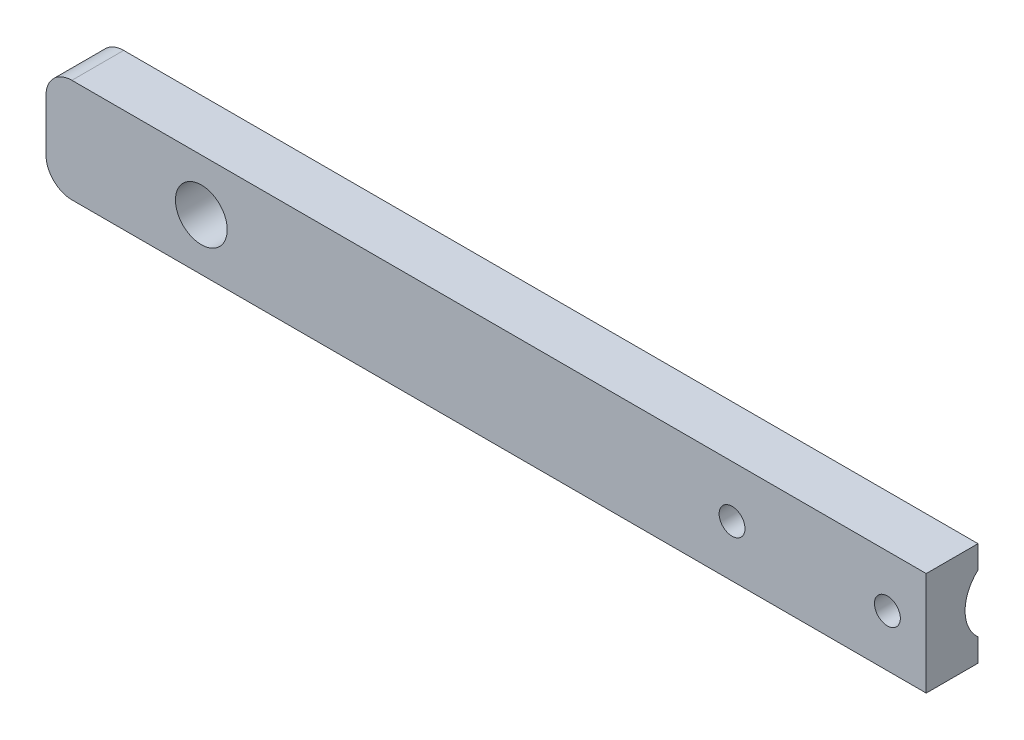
from build123d import *

# Parameters (mm, degrees)
SKETCH1_W           = 215.9
SKETCH1_H           = 25.4
SKETCH1_R           = 6.35
SKETCH1_R_2         = 3.175
BOSS_EXTRUDE1_DEPTH = 6.35
FILLET1_R           = 6.35
SKETCH2_R           = 9.525
CUT_EXTRUDE1_DEPTH  = 57.15


with BuildPart() as part:
    # Sketch1 → Boss-Extrude1 (new, symmetric)
    with BuildSketch(Plane.XY):
        with Locations((69.85, 0)):
            Rectangle(SKETCH1_W, SKETCH1_H)
        Circle(SKETCH1_R, mode=Mode.SUBTRACT)
        with Locations((168.275, 0)):
            Circle(SKETCH1_R_2, mode=Mode.SUBTRACT)
        with Locations((130.175, 0)):
            Circle(SKETCH1_R_2, mode=Mode.SUBTRACT)
    extrude(amount=BOSS_EXTRUDE1_DEPTH, both=True)

    # Fillet1
    fillet1_edges = [part.edges().sort_by_distance(p)[0] for p in [
        (-38.1, 12.7, 0),
        (-38.1, -12.7, 0),
    ]]
    fillet(fillet1_edges, radius=FILLET1_R)

    # Sketch2 → Cut-Extrude1 (cut)
    with BuildSketch(Plane(origin=(177.8, 0, 0), x_dir=(0, 0, -1), z_dir=(1, 0, 0))):
        with Locations((12.7, 0)):
            Circle(SKETCH2_R)
    extrude(amount=-CUT_EXTRUDE1_DEPTH, mode=Mode.SUBTRACT)


solid = part.part
